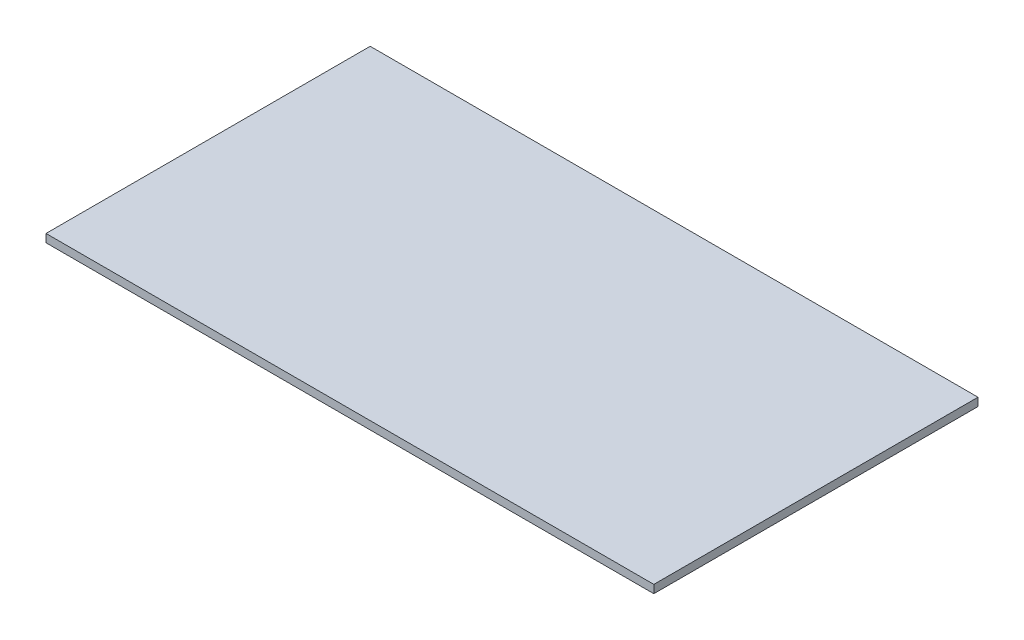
from build123d import *

# Parameters (mm, degrees)
SKETCH_1_W      = 150
SKETCH_1_H      = 80
EXTRUDE_1_DEPTH = 2


with BuildPart() as part:
    # Sketch 1 → Extrude 1 (new body)
    with BuildSketch(Plane(origin=(0, 0, 0), x_dir=(1, 0, 0), z_dir=(0, 1, 0))):
        Rectangle(SKETCH_1_W, SKETCH_1_H)
    extrude(amount=EXTRUDE_1_DEPTH)


solid = part.part
